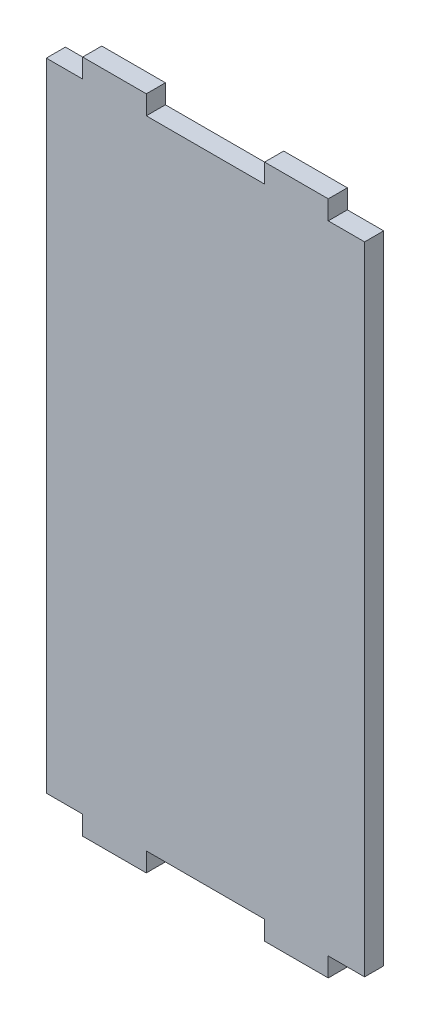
from build123d import *

# Parameters (mm, degrees)
BOSS_EXTRU_1_DEPTH = 3


with BuildPart() as part:
    # Esquisse1 → Boss.-Extru.1 (new body)
    with BuildSketch(Plane.XY):
        Polygon((25, -3), (19.289961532, -3), (19.289961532, 0), (9.289961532, 0), (9.289961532, -3), (-9.289961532, -3), (-9.289961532, 0), (-19.289961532, 0), (-19.289961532, -3), (-25, -3), (-25, -103), (-19.289961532, -103), (-19.289961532, -106), (-9.289961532, -106), (-9.289961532, -103), (9.289961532, -103), (9.289961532, -106), (19.289961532, -106), (19.289961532, -103), (25, -103), align=None)
    extrude(amount=-BOSS_EXTRU_1_DEPTH)


solid = part.part
